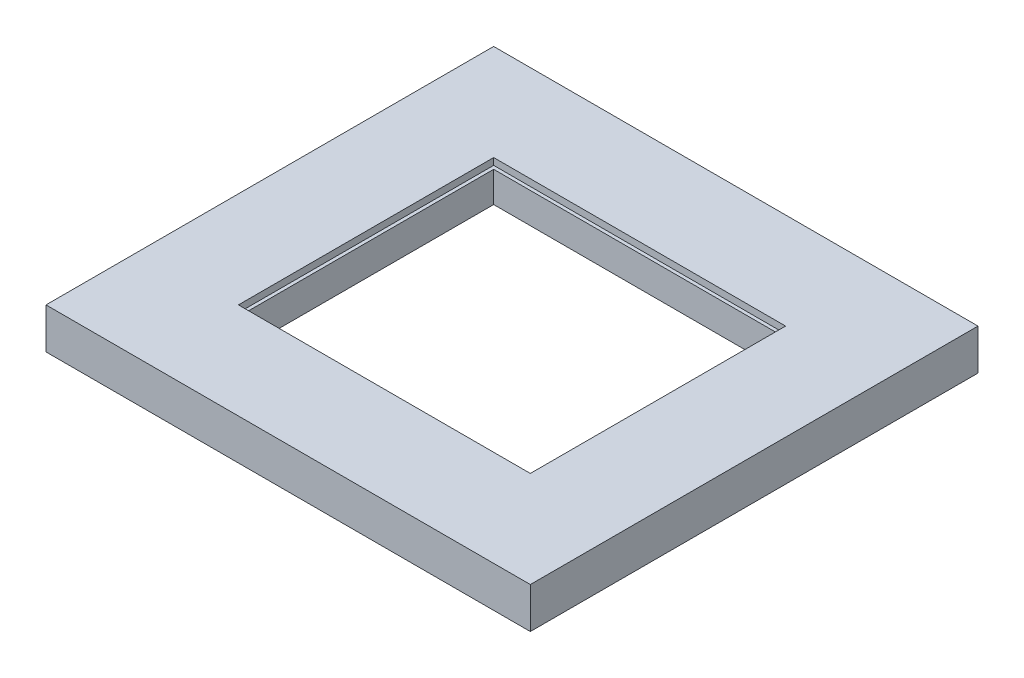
from build123d import *

# Parameters (mm, degrees)
SKETCH1_W           = 226.53
SKETCH1_H           = 209.38
SKETCH1_W_2         = 136.53
SKETCH1_H_2         = 119.38
BOSS_EXTRUDE1_DEPTH = 7.145
SKETCH2_W           = 226.53
SKETCH2_H           = 209.38
SKETCH2_W_2         = 187.33
SKETCH2_H_2         = 170.18
BOSS_EXTRUDE2_DEPTH = 1.59
SKETCH3_W           = 226.53
SKETCH3_H           = 209.38
SKETCH3_W_2         = 136.53
SKETCH3_H_2         = 119.38
BOSS_EXTRUDE3_DEPTH = 3.17


with BuildPart() as part:
    # Sketch1 → Boss-Extrude1 (new, symmetric)
    with BuildSketch(Plane(origin=(0, 0, 0), x_dir=(1, 0, 0), z_dir=(0, 1, 0))):
        Rectangle(SKETCH1_W, SKETCH1_H)
        Rectangle(SKETCH1_W_2, SKETCH1_H_2, mode=Mode.SUBTRACT)
    extrude(amount=BOSS_EXTRUDE1_DEPTH, both=True)

    # Sketch2 → Boss-Extrude2 (add)
    with BuildSketch(Plane(origin=(0, 7.145, 0), x_dir=(1, 0, 0), z_dir=(0, 1, 0))):
        Rectangle(SKETCH2_W, SKETCH2_H)
        Rectangle(SKETCH2_W_2, SKETCH2_H_2, mode=Mode.SUBTRACT)
    extrude(amount=BOSS_EXTRUDE2_DEPTH)

    # Sketch3 → Boss-Extrude3 (add)
    with BuildSketch(Plane(origin=(0, 8.735, 0), x_dir=(1, 0, 0), z_dir=(0, 1, 0))):
        Rectangle(SKETCH3_W, SKETCH3_H)
        Rectangle(SKETCH3_W_2, SKETCH3_H_2, mode=Mode.SUBTRACT)
    extrude(amount=BOSS_EXTRUDE3_DEPTH)


solid = part.part
